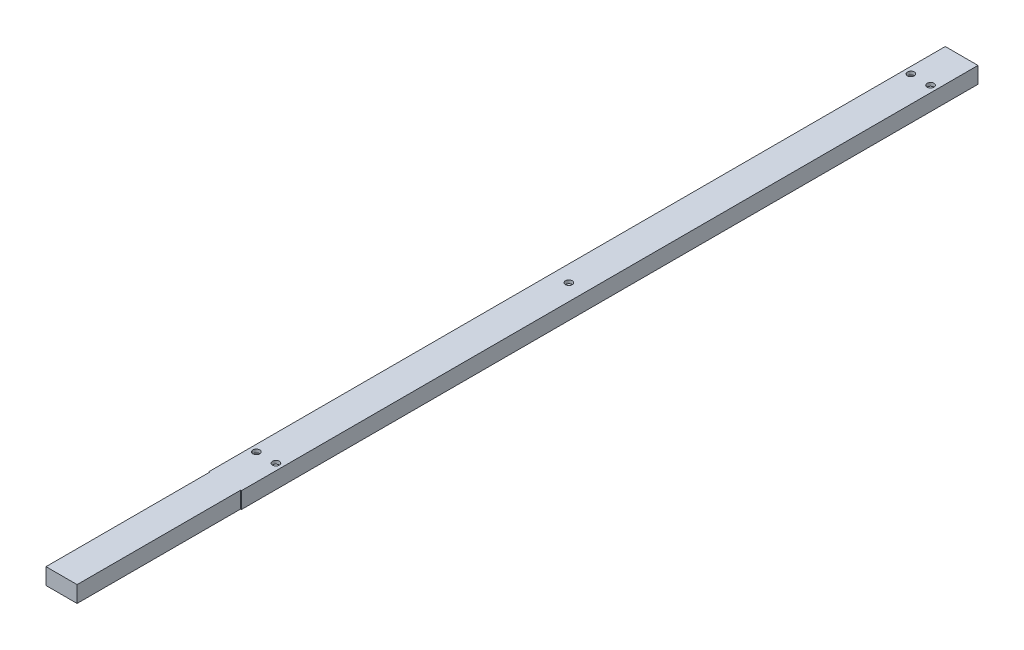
ISO-10303-21;
HEADER;
FILE_DESCRIPTION(('STEP AP214'),'2;1');
FILE_NAME('part.step','',(''),(''),'','','');
FILE_SCHEMA(('AUTOMOTIVE_DESIGN { 1 0 10303 214 1 1 1 1 }'));
ENDSEC;
DATA;
#1=APPLICATION_CONTEXT('core data for automotive mechanical design processes');
#2=APPLICATION_PROTOCOL_DEFINITION('international standard','automotive_design',2000,#1);
#3=PRODUCT_CONTEXT('',#1,'mechanical');
#4=PRODUCT('Part','Part','',(#3));
#5=PRODUCT_RELATED_PRODUCT_CATEGORY('part','',(#4));
#6=PRODUCT_DEFINITION_FORMATION('','',#4);
#7=PRODUCT_DEFINITION_CONTEXT('part definition',#1,'design');
#8=PRODUCT_DEFINITION('design','',#6,#7);
#9=PRODUCT_DEFINITION_SHAPE('','',#8);
#10=(LENGTH_UNIT() NAMED_UNIT(*) SI_UNIT(.MILLI.,.METRE.));
#11=(NAMED_UNIT(*) PLANE_ANGLE_UNIT() SI_UNIT($,.RADIAN.));
#12=(NAMED_UNIT(*) SI_UNIT($,.STERADIAN.) SOLID_ANGLE_UNIT());
#13=UNCERTAINTY_MEASURE_WITH_UNIT(LENGTH_MEASURE(1.E-05),#10,'distance_accuracy_value','');
#14=(GEOMETRIC_REPRESENTATION_CONTEXT(3) GLOBAL_UNCERTAINTY_ASSIGNED_CONTEXT((#13)) GLOBAL_UNIT_ASSIGNED_CONTEXT((#10,
#11,#12)) REPRESENTATION_CONTEXT('',''));
#15=CARTESIAN_POINT('',(0.,0.,0.));
#16=DIRECTION('',(0.,0.,1.));
#17=DIRECTION('',(1.,0.,0.));
#18=AXIS2_PLACEMENT_3D('',#15,#16,#17);
#19=CARTESIAN_POINT('',(0.,0.,450.));
#20=DIRECTION('',(0.,0.,1.));
#21=DIRECTION('',(1.,0.,0.));
#22=AXIS2_PLACEMENT_3D('',#19,#20,#21);
#23=PLANE('',#22);
#24=DIRECTION('',(1.,0.,0.));
#25=VECTOR('',#24,1.);
#26=CARTESIAN_POINT('',(-10.,-5.,450.));
#27=LINE('',#26,#25);
#28=CARTESIAN_POINT('',(-10.,-5.,450.));
#29=VERTEX_POINT('',#28);
#30=CARTESIAN_POINT('',(-9.5,-5.,450.));
#31=VERTEX_POINT('',#30);
#32=EDGE_CURVE('E322',#29,#31,#27,.T.);
#33=ORIENTED_EDGE('',*,*,#32,.T.);
#34=DIRECTION('',(0.,1.,0.));
#35=VECTOR('',#34,1.);
#36=CARTESIAN_POINT('',(-9.5,5.,450.));
#37=LINE('',#36,#35);
#38=CARTESIAN_POINT('',(-9.5,5.,450.));
#39=VERTEX_POINT('',#38);
#40=EDGE_CURVE('E199',#31,#39,#37,.T.);
#41=ORIENTED_EDGE('',*,*,#40,.T.);
#42=DIRECTION('',(-1.,0.,0.));
#43=VECTOR('',#42,1.);
#44=CARTESIAN_POINT('',(-10.,5.,450.));
#45=LINE('',#44,#43);
#46=CARTESIAN_POINT('',(-10.,5.,450.));
#47=VERTEX_POINT('',#46);
#48=EDGE_CURVE('E178',#39,#47,#45,.T.);
#49=ORIENTED_EDGE('',*,*,#48,.T.);
#50=DIRECTION('',(0.,-1.,0.));
#51=VECTOR('',#50,1.);
#52=CARTESIAN_POINT('',(-10.,5.,450.));
#53=LINE('',#52,#51);
#54=EDGE_CURVE('E319',#47,#29,#53,.T.);
#55=ORIENTED_EDGE('',*,*,#54,.T.);
#56=EDGE_LOOP('',(#33,#41,#49,#55));
#57=FACE_BOUND('',#56,.T.);
#58=ADVANCED_FACE('F35',(#57),#23,.T.);
#59=CARTESIAN_POINT('',(10.,5.,450.));
#60=VERTEX_POINT('',#59);
#61=CARTESIAN_POINT('',(9.5,5.,450.));
#62=VERTEX_POINT('',#61);
#63=EDGE_CURVE('E316',#60,#62,#45,.T.);
#64=ORIENTED_EDGE('',*,*,#63,.T.);
#65=DIRECTION('',(0.,-1.,0.));
#66=VECTOR('',#65,1.);
#67=CARTESIAN_POINT('',(9.5,5.,450.));
#68=LINE('',#67,#66);
#69=CARTESIAN_POINT('',(9.5,-5.,450.));
#70=VERTEX_POINT('',#69);
#71=EDGE_CURVE('E197',#62,#70,#68,.T.);
#72=ORIENTED_EDGE('',*,*,#71,.T.);
#73=CARTESIAN_POINT('',(10.,-5.,450.));
#74=VERTEX_POINT('',#73);
#75=EDGE_CURVE('E321',#70,#74,#27,.T.);
#76=ORIENTED_EDGE('',*,*,#75,.T.);
#77=DIRECTION('',(0.,1.,0.));
#78=VECTOR('',#77,1.);
#79=CARTESIAN_POINT('',(10.,5.,450.));
#80=LINE('',#79,#78);
#81=EDGE_CURVE('E312',#74,#60,#80,.T.);
#82=ORIENTED_EDGE('',*,*,#81,.T.);
#83=EDGE_LOOP('',(#64,#72,#76,#82));
#84=FACE_BOUND('',#83,.T.);
#85=ADVANCED_FACE('F419',(#84),#23,.T.);
#86=CARTESIAN_POINT('',(-8.,3.,450.));
#87=DIRECTION('',(1.,0.,0.));
#88=DIRECTION('',(0.,0.,-1.));
#89=AXIS2_PLACEMENT_3D('',#86,#87,#88);
#90=PLANE('',#89);
#91=DIRECTION('',(0.,1.,0.));
#92=VECTOR('',#91,1.);
#93=CARTESIAN_POINT('',(-8.,5.,424.359687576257));
#94=LINE('',#93,#92);
#95=CARTESIAN_POINT('',(-8.,-3.,424.359687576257));
#96=VERTEX_POINT('',#95);
#97=CARTESIAN_POINT('',(-8.,3.,424.359687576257));
#98=VERTEX_POINT('',#97);
#99=EDGE_CURVE('E224',#96,#98,#94,.T.);
#100=ORIENTED_EDGE('',*,*,#99,.F.);
#101=DIRECTION('',(0.,0.,-1.));
#102=VECTOR('',#101,1.);
#103=CARTESIAN_POINT('',(-8.,-3.,450.));
#104=LINE('',#103,#102);
#105=CARTESIAN_POINT('',(-8.,-3.,25.6403124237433));
#106=VERTEX_POINT('',#105);
#107=EDGE_CURVE('E301',#96,#106,#104,.T.);
#108=ORIENTED_EDGE('',*,*,#107,.T.);
#109=DIRECTION('',(0.,1.,0.));
#110=VECTOR('',#109,1.);
#111=CARTESIAN_POINT('',(-8.,5.,25.6403124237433));
#112=LINE('',#111,#110);
#113=CARTESIAN_POINT('',(-8.,3.,25.6403124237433));
#114=VERTEX_POINT('',#113);
#115=EDGE_CURVE('E246',#114,#106,#112,.F.);
#116=ORIENTED_EDGE('',*,*,#115,.F.);
#117=DIRECTION('',(0.,0.,-1.));
#118=VECTOR('',#117,1.);
#119=CARTESIAN_POINT('',(-8.,3.,450.));
#120=LINE('',#119,#118);
#121=EDGE_CURVE('E306',#98,#114,#120,.T.);
#122=ORIENTED_EDGE('',*,*,#121,.F.);
#123=EDGE_LOOP('',(#100,#108,#116,#122));
#124=FACE_BOUND('',#123,.T.);
#125=ADVANCED_FACE('F397',(#124),#90,.T.);
#126=CARTESIAN_POINT('',(8.,3.,450.));
#127=DIRECTION('',(-1.,0.,0.));
#128=DIRECTION('',(0.,0.,1.));
#129=AXIS2_PLACEMENT_3D('',#126,#127,#128);
#130=PLANE('',#129);
#131=DIRECTION('',(0.,1.,0.));
#132=VECTOR('',#131,1.);
#133=CARTESIAN_POINT('',(8.,5.,425.640312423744));
#134=LINE('',#133,#132);
#135=CARTESIAN_POINT('',(8.,-3.,425.640312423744));
#136=VERTEX_POINT('',#135);
#137=CARTESIAN_POINT('',(8.,3.,425.640312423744));
#138=VERTEX_POINT('',#137);
#139=EDGE_CURVE('E236',#136,#138,#134,.T.);
#140=ORIENTED_EDGE('',*,*,#139,.F.);
#141=DIRECTION('',(0.,0.,-1.));
#142=VECTOR('',#141,1.);
#143=CARTESIAN_POINT('',(8.,-3.,450.));
#144=LINE('',#143,#142);
#145=CARTESIAN_POINT('',(8.,-3.,450.));
#146=VERTEX_POINT('',#145);
#147=EDGE_CURVE('E292',#146,#136,#144,.T.);
#148=ORIENTED_EDGE('',*,*,#147,.F.);
#149=DIRECTION('',(0.,1.,0.));
#150=VECTOR('',#149,1.);
#151=CARTESIAN_POINT('',(8.,3.,450.));
#152=LINE('',#151,#150);
#153=CARTESIAN_POINT('',(8.,3.,450.));
#154=VERTEX_POINT('',#153);
#155=EDGE_CURVE('E268',#146,#154,#152,.T.);
#156=ORIENTED_EDGE('',*,*,#155,.T.);
#157=DIRECTION('',(0.,0.,-1.));
#158=VECTOR('',#157,1.);
#159=CARTESIAN_POINT('',(8.,3.,450.));
#160=LINE('',#159,#158);
#161=EDGE_CURVE('E307',#154,#138,#160,.T.);
#162=ORIENTED_EDGE('',*,*,#161,.T.);
#163=EDGE_LOOP('',(#140,#148,#156,#162));
#164=FACE_BOUND('',#163,.T.);
#165=ADVANCED_FACE('F360',(#164),#130,.T.);
#166=DIRECTION('',(0.,1.,0.));
#167=VECTOR('',#166,1.);
#168=CARTESIAN_POINT('',(-8.,5.,24.3596875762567));
#169=LINE('',#168,#167);
#170=CARTESIAN_POINT('',(-8.,-3.,24.3596875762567));
#171=VERTEX_POINT('',#170);
#172=CARTESIAN_POINT('',(-8.,3.,24.3596875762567));
#173=VERTEX_POINT('',#172);
#174=EDGE_CURVE('E249',#171,#173,#169,.T.);
#175=ORIENTED_EDGE('',*,*,#174,.F.);
#176=CARTESIAN_POINT('',(-8.,-3.,0.));
#177=VERTEX_POINT('',#176);
#178=EDGE_CURVE('E295',#171,#177,#104,.T.);
#179=ORIENTED_EDGE('',*,*,#178,.T.);
#180=DIRECTION('',(0.,-1.,0.));
#181=VECTOR('',#180,1.);
#182=CARTESIAN_POINT('',(-8.,3.,0.));
#183=LINE('',#182,#181);
#184=CARTESIAN_POINT('',(-8.,3.,0.));
#185=VERTEX_POINT('',#184);
#186=EDGE_CURVE('E287',#185,#177,#183,.T.);
#187=ORIENTED_EDGE('',*,*,#186,.F.);
#188=EDGE_CURVE('E300',#173,#185,#120,.T.);
#189=ORIENTED_EDGE('',*,*,#188,.F.);
#190=EDGE_LOOP('',(#175,#179,#187,#189));
#191=FACE_BOUND('',#190,.T.);
#192=ADVANCED_FACE('F391',(#191),#90,.T.);
#193=DIRECTION('',(0.,1.,0.));
#194=VECTOR('',#193,1.);
#195=CARTESIAN_POINT('',(8.,5.,424.359687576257));
#196=LINE('',#195,#194);
#197=CARTESIAN_POINT('',(8.,3.,424.359687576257));
#198=VERTEX_POINT('',#197);
#199=CARTESIAN_POINT('',(8.,-3.,424.359687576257));
#200=VERTEX_POINT('',#199);
#201=EDGE_CURVE('E234',#198,#200,#196,.F.);
#202=ORIENTED_EDGE('',*,*,#201,.F.);
#203=CARTESIAN_POINT('',(8.,3.,25.6403124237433));
#204=VERTEX_POINT('',#203);
#205=EDGE_CURVE('E311',#198,#204,#160,.T.);
#206=ORIENTED_EDGE('',*,*,#205,.T.);
#207=DIRECTION('',(0.,1.,0.));
#208=VECTOR('',#207,1.);
#209=CARTESIAN_POINT('',(8.,5.,25.6403124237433));
#210=LINE('',#209,#208);
#211=CARTESIAN_POINT('',(8.,-3.,25.6403124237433));
#212=VERTEX_POINT('',#211);
#213=EDGE_CURVE('E264',#212,#204,#210,.T.);
#214=ORIENTED_EDGE('',*,*,#213,.F.);
#215=EDGE_CURVE('E296',#200,#212,#144,.T.);
#216=ORIENTED_EDGE('',*,*,#215,.F.);
#217=EDGE_LOOP('',(#202,#206,#214,#216));
#218=FACE_BOUND('',#217,.T.);
#219=ADVANCED_FACE('F373',(#218),#130,.T.);
#220=CARTESIAN_POINT('',(0.,0.,0.));
#221=DIRECTION('',(0.,0.,1.));
#222=DIRECTION('',(1.,0.,0.));
#223=AXIS2_PLACEMENT_3D('',#220,#221,#222);
#224=PLANE('',#223);
#225=DIRECTION('',(0.,1.,0.));
#226=VECTOR('',#225,1.);
#227=CARTESIAN_POINT('',(10.,5.,0.));
#228=LINE('',#227,#226);
#229=CARTESIAN_POINT('',(10.,-5.,0.));
#230=VERTEX_POINT('',#229);
#231=CARTESIAN_POINT('',(10.,5.,0.));
#232=VERTEX_POINT('',#231);
#233=EDGE_CURVE('E310',#230,#232,#228,.T.);
#234=ORIENTED_EDGE('',*,*,#233,.F.);
#235=DIRECTION('',(1.,0.,0.));
#236=VECTOR('',#235,1.);
#237=CARTESIAN_POINT('',(-10.,-5.,0.));
#238=LINE('',#237,#236);
#239=CARTESIAN_POINT('',(-10.,-5.,0.));
#240=VERTEX_POINT('',#239);
#241=EDGE_CURVE('E315',#240,#230,#238,.T.);
#242=ORIENTED_EDGE('',*,*,#241,.F.);
#243=DIRECTION('',(0.,-1.,0.));
#244=VECTOR('',#243,1.);
#245=CARTESIAN_POINT('',(-10.,5.,0.));
#246=LINE('',#245,#244);
#247=CARTESIAN_POINT('',(-10.,5.,0.));
#248=VERTEX_POINT('',#247);
#249=EDGE_CURVE('E330',#248,#240,#246,.T.);
#250=ORIENTED_EDGE('',*,*,#249,.F.);
#251=DIRECTION('',(-1.,0.,0.));
#252=VECTOR('',#251,1.);
#253=CARTESIAN_POINT('',(-10.,5.,0.));
#254=LINE('',#253,#252);
#255=EDGE_CURVE('E328',#232,#248,#254,.T.);
#256=ORIENTED_EDGE('',*,*,#255,.F.);
#257=EDGE_LOOP('',(#234,#242,#250,#256));
#258=FACE_BOUND('',#257,.T.);
#259=DIRECTION('',(0.,1.,0.));
#260=VECTOR('',#259,1.);
#261=CARTESIAN_POINT('',(8.,3.,0.));
#262=LINE('',#261,#260);
#263=CARTESIAN_POINT('',(8.,-3.,0.));
#264=VERTEX_POINT('',#263);
#265=CARTESIAN_POINT('',(8.,3.,0.));
#266=VERTEX_POINT('',#265);
#267=EDGE_CURVE('E267',#264,#266,#262,.T.);
#268=ORIENTED_EDGE('',*,*,#267,.T.);
#269=DIRECTION('',(-1.,0.,0.));
#270=VECTOR('',#269,1.);
#271=CARTESIAN_POINT('',(-8.,3.,0.));
#272=LINE('',#271,#270);
#273=EDGE_CURVE('E284',#266,#185,#272,.T.);
#274=ORIENTED_EDGE('',*,*,#273,.T.);
#275=ORIENTED_EDGE('',*,*,#186,.T.);
#276=DIRECTION('',(1.,0.,0.));
#277=VECTOR('',#276,1.);
#278=CARTESIAN_POINT('',(-8.,-3.,0.));
#279=LINE('',#278,#277);
#280=EDGE_CURVE('E272',#177,#264,#279,.T.);
#281=ORIENTED_EDGE('',*,*,#280,.T.);
#282=EDGE_LOOP('',(#268,#274,#275,#281));
#283=FACE_BOUND('',#282,.T.);
#284=ADVANCED_FACE('F386',(#258,#283),#224,.F.);
#285=CARTESIAN_POINT('',(10.,5.,450.));
#286=DIRECTION('',(-1.,0.,0.));
#287=DIRECTION('',(0.,-1.,0.));
#288=AXIS2_PLACEMENT_3D('',#285,#286,#287);
#289=PLANE('',#288);
#290=ORIENTED_EDGE('',*,*,#233,.T.);
#291=DIRECTION('',(0.,0.,-1.));
#292=VECTOR('',#291,1.);
#293=CARTESIAN_POINT('',(10.,5.,450.));
#294=LINE('',#293,#292);
#295=EDGE_CURVE('E341',#60,#232,#294,.T.);
#296=ORIENTED_EDGE('',*,*,#295,.F.);
#297=ORIENTED_EDGE('',*,*,#81,.F.);
#298=DIRECTION('',(0.,0.,-1.));
#299=VECTOR('',#298,1.);
#300=CARTESIAN_POINT('',(10.,-5.,450.));
#301=LINE('',#300,#299);
#302=EDGE_CURVE('E325',#74,#230,#301,.T.);
#303=ORIENTED_EDGE('',*,*,#302,.T.);
#304=EDGE_LOOP('',(#290,#296,#297,#303));
#305=FACE_BOUND('',#304,.T.);
#306=ADVANCED_FACE('F37',(#305),#289,.F.);
#307=CARTESIAN_POINT('',(-10.,5.,450.));
#308=DIRECTION('',(0.,-1.,0.));
#309=DIRECTION('',(0.,0.,-1.));
#310=AXIS2_PLACEMENT_3D('',#307,#308,#309);
#311=PLANE('',#310);
#312=CARTESIAN_POINT('',(0.,5.,240.));
#313=DIRECTION('',(0.,-1.,0.));
#314=DIRECTION('',(0.,0.,-1.));
#315=AXIS2_PLACEMENT_3D('',#312,#313,#314);
#316=CIRCLE('',#315,2.1);
#317=CARTESIAN_POINT('',(0.,5.,237.9));
#318=VERTEX_POINT('',#317);
#319=EDGE_CURVE('E211',#318,#318,#316,.T.);
#320=ORIENTED_EDGE('',*,*,#319,.T.);
#321=EDGE_LOOP('',(#320));
#322=FACE_BOUND('',#321,.T.);
#323=CARTESIAN_POINT('',(-5.99999999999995,5.,425.));
#324=DIRECTION('',(0.,1.,0.));
#325=DIRECTION('',(0.,0.,1.));
#326=AXIS2_PLACEMENT_3D('',#323,#324,#325);
#327=CIRCLE('',#326,2.1);
#328=CARTESIAN_POINT('',(-5.99999999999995,5.,427.1));
#329=VERTEX_POINT('',#328);
#330=EDGE_CURVE('E217',#329,#329,#327,.T.);
#331=ORIENTED_EDGE('',*,*,#330,.F.);
#332=EDGE_LOOP('',(#331));
#333=FACE_BOUND('',#332,.T.);
#334=CARTESIAN_POINT('',(6.00000000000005,5.,425.));
#335=DIRECTION('',(0.,1.,0.));
#336=DIRECTION('',(0.,0.,1.));
#337=AXIS2_PLACEMENT_3D('',#334,#335,#336);
#338=CIRCLE('',#337,2.1);
#339=CARTESIAN_POINT('',(6.00000000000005,5.,427.1));
#340=VERTEX_POINT('',#339);
#341=EDGE_CURVE('E228',#340,#340,#338,.T.);
#342=ORIENTED_EDGE('',*,*,#341,.F.);
#343=EDGE_LOOP('',(#342));
#344=FACE_BOUND('',#343,.T.);
#345=CARTESIAN_POINT('',(-6.,5.,25.));
#346=DIRECTION('',(0.,1.,0.));
#347=DIRECTION('',(0.,0.,1.));
#348=AXIS2_PLACEMENT_3D('',#345,#346,#347);
#349=CIRCLE('',#348,2.1);
#350=CARTESIAN_POINT('',(-6.,5.,27.1));
#351=VERTEX_POINT('',#350);
#352=EDGE_CURVE('E240',#351,#351,#349,.T.);
#353=ORIENTED_EDGE('',*,*,#352,.F.);
#354=EDGE_LOOP('',(#353));
#355=FACE_BOUND('',#354,.T.);
#356=CARTESIAN_POINT('',(6.,5.,25.));
#357=DIRECTION('',(0.,1.,0.));
#358=DIRECTION('',(0.,0.,1.));
#359=AXIS2_PLACEMENT_3D('',#356,#357,#358);
#360=CIRCLE('',#359,2.1);
#361=CARTESIAN_POINT('',(6.,5.,27.1));
#362=VERTEX_POINT('',#361);
#363=EDGE_CURVE('E254',#362,#362,#360,.T.);
#364=ORIENTED_EDGE('',*,*,#363,.F.);
#365=EDGE_LOOP('',(#364));
#366=FACE_BOUND('',#365,.T.);
#367=ORIENTED_EDGE('',*,*,#255,.T.);
#368=DIRECTION('',(0.,0.,-1.));
#369=VECTOR('',#368,1.);
#370=CARTESIAN_POINT('',(-10.,5.,450.));
#371=LINE('',#370,#369);
#372=EDGE_CURVE('E338',#47,#248,#371,.T.);
#373=ORIENTED_EDGE('',*,*,#372,.F.);
#374=ORIENTED_EDGE('',*,*,#48,.F.);
#375=DIRECTION('',(0.,0.,-1.));
#376=VECTOR('',#375,1.);
#377=CARTESIAN_POINT('',(-9.5,5.,550.));
#378=LINE('',#377,#376);
#379=CARTESIAN_POINT('',(-9.5,5.,550.));
#380=VERTEX_POINT('',#379);
#381=EDGE_CURVE('E173',#380,#39,#378,.T.);
#382=ORIENTED_EDGE('',*,*,#381,.F.);
#383=DIRECTION('',(1.,0.,0.));
#384=VECTOR('',#383,1.);
#385=CARTESIAN_POINT('',(9.5,5.,550.));
#386=LINE('',#385,#384);
#387=CARTESIAN_POINT('',(9.5,5.,550.));
#388=VERTEX_POINT('',#387);
#389=EDGE_CURVE('E176',#380,#388,#386,.T.);
#390=ORIENTED_EDGE('',*,*,#389,.T.);
#391=DIRECTION('',(0.,0.,-1.));
#392=VECTOR('',#391,1.);
#393=CARTESIAN_POINT('',(9.5,5.,550.));
#394=LINE('',#393,#392);
#395=EDGE_CURVE('E183',#388,#62,#394,.T.);
#396=ORIENTED_EDGE('',*,*,#395,.T.);
#397=ORIENTED_EDGE('',*,*,#63,.F.);
#398=ORIENTED_EDGE('',*,*,#295,.T.);
#399=EDGE_LOOP('',(#367,#373,#374,#382,#390,#396,#397,#398));
#400=FACE_BOUND('',#399,.T.);
#401=ADVANCED_FACE('F175',(#322,#333,#344,#355,#366,#400),#311,.F.);
#402=CARTESIAN_POINT('',(-10.,5.,450.));
#403=DIRECTION('',(1.,0.,0.));
#404=DIRECTION('',(0.,0.,-1.));
#405=AXIS2_PLACEMENT_3D('',#402,#403,#404);
#406=PLANE('',#405);
#407=ORIENTED_EDGE('',*,*,#249,.T.);
#408=DIRECTION('',(0.,0.,-1.));
#409=VECTOR('',#408,1.);
#410=CARTESIAN_POINT('',(-10.,-5.,450.));
#411=LINE('',#410,#409);
#412=EDGE_CURVE('E335',#29,#240,#411,.T.);
#413=ORIENTED_EDGE('',*,*,#412,.F.);
#414=ORIENTED_EDGE('',*,*,#54,.F.);
#415=ORIENTED_EDGE('',*,*,#372,.T.);
#416=EDGE_LOOP('',(#407,#413,#414,#415));
#417=FACE_BOUND('',#416,.T.);
#418=ADVANCED_FACE('F437',(#417),#406,.F.);
#419=CARTESIAN_POINT('',(-10.,-5.,450.));
#420=DIRECTION('',(0.,1.,0.));
#421=DIRECTION('',(0.,0.,1.));
#422=AXIS2_PLACEMENT_3D('',#419,#420,#421);
#423=PLANE('',#422);
#424=CARTESIAN_POINT('',(0.,-5.,240.));
#425=DIRECTION('',(0.,-1.,0.));
#426=DIRECTION('',(0.,0.,-1.));
#427=AXIS2_PLACEMENT_3D('',#424,#425,#426);
#428=CIRCLE('',#427,2.09999999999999);
#429=CARTESIAN_POINT('',(0.,-5.,237.9));
#430=VERTEX_POINT('',#429);
#431=EDGE_CURVE('E206',#430,#430,#428,.T.);
#432=ORIENTED_EDGE('',*,*,#431,.F.);
#433=EDGE_LOOP('',(#432));
#434=FACE_BOUND('',#433,.T.);
#435=CARTESIAN_POINT('',(-5.99999999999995,-5.,425.));
#436=DIRECTION('',(0.,1.,0.));
#437=DIRECTION('',(0.,0.,1.));
#438=AXIS2_PLACEMENT_3D('',#435,#436,#437);
#439=CIRCLE('',#438,2.1);
#440=CARTESIAN_POINT('',(-5.99999999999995,-5.,427.1));
#441=VERTEX_POINT('',#440);
#442=EDGE_CURVE('E220',#441,#441,#439,.T.);
#443=ORIENTED_EDGE('',*,*,#442,.T.);
#444=EDGE_LOOP('',(#443));
#445=FACE_BOUND('',#444,.T.);
#446=CARTESIAN_POINT('',(6.00000000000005,-5.,425.));
#447=DIRECTION('',(0.,1.,0.));
#448=DIRECTION('',(0.,0.,1.));
#449=AXIS2_PLACEMENT_3D('',#446,#447,#448);
#450=CIRCLE('',#449,2.1);
#451=CARTESIAN_POINT('',(6.00000000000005,-5.,427.1));
#452=VERTEX_POINT('',#451);
#453=EDGE_CURVE('E231',#452,#452,#450,.T.);
#454=ORIENTED_EDGE('',*,*,#453,.T.);
#455=EDGE_LOOP('',(#454));
#456=FACE_BOUND('',#455,.T.);
#457=CARTESIAN_POINT('',(-6.,-5.,25.));
#458=DIRECTION('',(0.,1.,0.));
#459=DIRECTION('',(0.,0.,1.));
#460=AXIS2_PLACEMENT_3D('',#457,#458,#459);
#461=CIRCLE('',#460,2.1);
#462=CARTESIAN_POINT('',(-6.,-5.,27.1));
#463=VERTEX_POINT('',#462);
#464=EDGE_CURVE('E243',#463,#463,#461,.T.);
#465=ORIENTED_EDGE('',*,*,#464,.T.);
#466=EDGE_LOOP('',(#465));
#467=FACE_BOUND('',#466,.T.);
#468=CARTESIAN_POINT('',(6.,-5.,25.));
#469=DIRECTION('',(0.,1.,0.));
#470=DIRECTION('',(0.,0.,1.));
#471=AXIS2_PLACEMENT_3D('',#468,#469,#470);
#472=CIRCLE('',#471,2.1);
#473=CARTESIAN_POINT('',(6.,-5.,27.1));
#474=VERTEX_POINT('',#473);
#475=EDGE_CURVE('E257',#474,#474,#472,.T.);
#476=ORIENTED_EDGE('',*,*,#475,.T.);
#477=EDGE_LOOP('',(#476));
#478=FACE_BOUND('',#477,.T.);
#479=ORIENTED_EDGE('',*,*,#241,.T.);
#480=ORIENTED_EDGE('',*,*,#302,.F.);
#481=ORIENTED_EDGE('',*,*,#75,.F.);
#482=DIRECTION('',(0.,0.,-1.));
#483=VECTOR('',#482,1.);
#484=CARTESIAN_POINT('',(9.5,-5.,550.));
#485=LINE('',#484,#483);
#486=CARTESIAN_POINT('',(9.5,-5.,550.));
#487=VERTEX_POINT('',#486);
#488=EDGE_CURVE('E51',#487,#70,#485,.T.);
#489=ORIENTED_EDGE('',*,*,#488,.F.);
#490=DIRECTION('',(-1.,0.,0.));
#491=VECTOR('',#490,1.);
#492=CARTESIAN_POINT('',(9.5,-5.,550.));
#493=LINE('',#492,#491);
#494=CARTESIAN_POINT('',(-9.5,-5.,550.));
#495=VERTEX_POINT('',#494);
#496=EDGE_CURVE('E184',#487,#495,#493,.T.);
#497=ORIENTED_EDGE('',*,*,#496,.T.);
#498=DIRECTION('',(0.,0.,-1.));
#499=VECTOR('',#498,1.);
#500=CARTESIAN_POINT('',(-9.5,-5.,550.));
#501=LINE('',#500,#499);
#502=EDGE_CURVE('E196',#495,#31,#501,.T.);
#503=ORIENTED_EDGE('',*,*,#502,.T.);
#504=ORIENTED_EDGE('',*,*,#32,.F.);
#505=ORIENTED_EDGE('',*,*,#412,.T.);
#506=EDGE_LOOP('',(#479,#480,#481,#489,#497,#503,#504,#505));
#507=FACE_BOUND('',#506,.T.);
#508=ADVANCED_FACE('F434',(#434,#445,#456,#467,#478,#507),#423,.F.);
#509=DIRECTION('',(0.,1.,0.));
#510=VECTOR('',#509,1.);
#511=CARTESIAN_POINT('',(8.,5.,24.3596875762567));
#512=LINE('',#511,#510);
#513=CARTESIAN_POINT('',(8.,3.,24.3596875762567));
#514=VERTEX_POINT('',#513);
#515=CARTESIAN_POINT('',(8.,-3.,24.3596875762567));
#516=VERTEX_POINT('',#515);
#517=EDGE_CURVE('E260',#514,#516,#512,.F.);
#518=ORIENTED_EDGE('',*,*,#517,.F.);
#519=EDGE_CURVE('E305',#514,#266,#160,.T.);
#520=ORIENTED_EDGE('',*,*,#519,.T.);
#521=ORIENTED_EDGE('',*,*,#267,.F.);
#522=EDGE_CURVE('E281',#516,#264,#144,.T.);
#523=ORIENTED_EDGE('',*,*,#522,.F.);
#524=EDGE_LOOP('',(#518,#520,#521,#523));
#525=FACE_BOUND('',#524,.T.);
#526=ADVANCED_FACE('F382',(#525),#130,.T.);
#527=CARTESIAN_POINT('',(-8.,3.,450.));
#528=DIRECTION('',(0.,-1.,0.));
#529=DIRECTION('',(0.,0.,-1.));
#530=AXIS2_PLACEMENT_3D('',#527,#528,#529);
#531=PLANE('',#530);
#532=CARTESIAN_POINT('',(0.,3.,240.));
#533=DIRECTION('',(0.,-1.,0.));
#534=DIRECTION('',(0.,0.,-1.));
#535=AXIS2_PLACEMENT_3D('',#532,#533,#534);
#536=CIRCLE('',#535,2.09999999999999);
#537=CARTESIAN_POINT('',(0.,3.,237.9));
#538=VERTEX_POINT('',#537);
#539=EDGE_CURVE('E214',#538,#538,#536,.T.);
#540=ORIENTED_EDGE('',*,*,#539,.F.);
#541=EDGE_LOOP('',(#540));
#542=FACE_BOUND('',#541,.T.);
#543=CARTESIAN_POINT('',(-5.99999999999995,3.,425.));
#544=DIRECTION('',(0.,-1.,0.));
#545=DIRECTION('',(0.,0.,-1.));
#546=AXIS2_PLACEMENT_3D('',#543,#544,#545);
#547=CIRCLE('',#546,2.1);
#548=CARTESIAN_POINT('',(-8.,3.,425.640312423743));
#549=VERTEX_POINT('',#548);
#550=EDGE_CURVE('E226',#98,#549,#547,.T.);
#551=ORIENTED_EDGE('',*,*,#550,.F.);
#552=ORIENTED_EDGE('',*,*,#121,.T.);
#553=CARTESIAN_POINT('',(-6.,3.,25.));
#554=DIRECTION('',(0.,-1.,0.));
#555=DIRECTION('',(0.,0.,-1.));
#556=AXIS2_PLACEMENT_3D('',#553,#554,#555);
#557=CIRCLE('',#556,2.1);
#558=EDGE_CURVE('E251',#173,#114,#557,.T.);
#559=ORIENTED_EDGE('',*,*,#558,.F.);
#560=ORIENTED_EDGE('',*,*,#188,.T.);
#561=ORIENTED_EDGE('',*,*,#273,.F.);
#562=ORIENTED_EDGE('',*,*,#519,.F.);
#563=CARTESIAN_POINT('',(6.,3.,25.));
#564=DIRECTION('',(0.,-1.,0.));
#565=DIRECTION('',(0.,0.,-1.));
#566=AXIS2_PLACEMENT_3D('',#563,#564,#565);
#567=CIRCLE('',#566,2.1);
#568=EDGE_CURVE('E262',#204,#514,#567,.T.);
#569=ORIENTED_EDGE('',*,*,#568,.F.);
#570=ORIENTED_EDGE('',*,*,#205,.F.);
#571=CARTESIAN_POINT('',(6.00000000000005,3.,425.));
#572=DIRECTION('',(0.,-1.,0.));
#573=DIRECTION('',(0.,0.,-1.));
#574=AXIS2_PLACEMENT_3D('',#571,#572,#573);
#575=CIRCLE('',#574,2.1);
#576=EDGE_CURVE('E238',#138,#198,#575,.T.);
#577=ORIENTED_EDGE('',*,*,#576,.F.);
#578=ORIENTED_EDGE('',*,*,#161,.F.);
#579=DIRECTION('',(-1.,0.,0.));
#580=VECTOR('',#579,1.);
#581=CARTESIAN_POINT('',(-8.,3.,450.));
#582=LINE('',#581,#580);
#583=CARTESIAN_POINT('',(-8.,3.,450.));
#584=VERTEX_POINT('',#583);
#585=EDGE_CURVE('E271',#154,#584,#582,.T.);
#586=ORIENTED_EDGE('',*,*,#585,.T.);
#587=EDGE_CURVE('E302',#584,#549,#120,.T.);
#588=ORIENTED_EDGE('',*,*,#587,.T.);
#589=EDGE_LOOP('',(#551,#552,#559,#560,#561,#562,#569,#570,#577,#578,#586,#588));
#590=FACE_BOUND('',#589,.T.);
#591=ADVANCED_FACE('F368',(#542,#590),#531,.T.);
#592=DIRECTION('',(0.,1.,0.));
#593=VECTOR('',#592,1.);
#594=CARTESIAN_POINT('',(-8.,5.,425.640312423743));
#595=LINE('',#594,#593);
#596=CARTESIAN_POINT('',(-8.,-3.,425.640312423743));
#597=VERTEX_POINT('',#596);
#598=EDGE_CURVE('E58',#549,#597,#595,.F.);
#599=ORIENTED_EDGE('',*,*,#598,.F.);
#600=ORIENTED_EDGE('',*,*,#587,.F.);
#601=DIRECTION('',(0.,-1.,0.));
#602=VECTOR('',#601,1.);
#603=CARTESIAN_POINT('',(-8.,3.,450.));
#604=LINE('',#603,#602);
#605=CARTESIAN_POINT('',(-8.,-3.,450.));
#606=VERTEX_POINT('',#605);
#607=EDGE_CURVE('E275',#584,#606,#604,.T.);
#608=ORIENTED_EDGE('',*,*,#607,.T.);
#609=EDGE_CURVE('E297',#606,#597,#104,.T.);
#610=ORIENTED_EDGE('',*,*,#609,.T.);
#611=EDGE_LOOP('',(#599,#600,#608,#610));
#612=FACE_BOUND('',#611,.T.);
#613=ADVANCED_FACE('F406',(#612),#90,.T.);
#614=CARTESIAN_POINT('',(-8.,-3.,450.));
#615=DIRECTION('',(0.,1.,0.));
#616=DIRECTION('',(0.,0.,1.));
#617=AXIS2_PLACEMENT_3D('',#614,#615,#616);
#618=PLANE('',#617);
#619=CARTESIAN_POINT('',(0.,-3.,240.));
#620=DIRECTION('',(0.,1.,0.));
#621=DIRECTION('',(0.,0.,1.));
#622=AXIS2_PLACEMENT_3D('',#619,#620,#621);
#623=CIRCLE('',#622,2.09999999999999);
#624=CARTESIAN_POINT('',(0.,-3.,242.1));
#625=VERTEX_POINT('',#624);
#626=EDGE_CURVE('E39',#625,#625,#623,.T.);
#627=ORIENTED_EDGE('',*,*,#626,.F.);
#628=EDGE_LOOP('',(#627));
#629=FACE_BOUND('',#628,.T.);
#630=CARTESIAN_POINT('',(-5.99999999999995,-3.,425.));
#631=DIRECTION('',(0.,1.,0.));
#632=DIRECTION('',(0.,0.,1.));
#633=AXIS2_PLACEMENT_3D('',#630,#631,#632);
#634=CIRCLE('',#633,2.1);
#635=EDGE_CURVE('E11',#597,#96,#634,.T.);
#636=ORIENTED_EDGE('',*,*,#635,.F.);
#637=ORIENTED_EDGE('',*,*,#609,.F.);
#638=DIRECTION('',(1.,0.,0.));
#639=VECTOR('',#638,1.);
#640=CARTESIAN_POINT('',(-8.,-3.,450.));
#641=LINE('',#640,#639);
#642=EDGE_CURVE('E278',#606,#146,#641,.T.);
#643=ORIENTED_EDGE('',*,*,#642,.T.);
#644=ORIENTED_EDGE('',*,*,#147,.T.);
#645=CARTESIAN_POINT('',(6.00000000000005,-3.,425.));
#646=DIRECTION('',(0.,1.,0.));
#647=DIRECTION('',(0.,0.,1.));
#648=AXIS2_PLACEMENT_3D('',#645,#646,#647);
#649=CIRCLE('',#648,2.1);
#650=EDGE_CURVE('E44',#200,#136,#649,.T.);
#651=ORIENTED_EDGE('',*,*,#650,.F.);
#652=ORIENTED_EDGE('',*,*,#215,.T.);
#653=CARTESIAN_POINT('',(6.,-3.,25.));
#654=DIRECTION('',(0.,1.,0.));
#655=DIRECTION('',(0.,0.,1.));
#656=AXIS2_PLACEMENT_3D('',#653,#654,#655);
#657=CIRCLE('',#656,2.1);
#658=EDGE_CURVE('E344',#516,#212,#657,.T.);
#659=ORIENTED_EDGE('',*,*,#658,.F.);
#660=ORIENTED_EDGE('',*,*,#522,.T.);
#661=ORIENTED_EDGE('',*,*,#280,.F.);
#662=ORIENTED_EDGE('',*,*,#178,.F.);
#663=CARTESIAN_POINT('',(-6.,-3.,25.));
#664=DIRECTION('',(0.,1.,0.));
#665=DIRECTION('',(0.,0.,1.));
#666=AXIS2_PLACEMENT_3D('',#663,#664,#665);
#667=CIRCLE('',#666,2.1);
#668=EDGE_CURVE('E347',#106,#171,#667,.T.);
#669=ORIENTED_EDGE('',*,*,#668,.F.);
#670=ORIENTED_EDGE('',*,*,#107,.F.);
#671=EDGE_LOOP('',(#636,#637,#643,#644,#651,#652,#659,#660,#661,#662,#669,#670));
#672=FACE_BOUND('',#671,.T.);
#673=ADVANCED_FACE('F362',(#629,#672),#618,.T.);
#674=CARTESIAN_POINT('',(6.,5.,25.));
#675=DIRECTION('',(0.,1.,0.));
#676=DIRECTION('',(0.,0.,1.));
#677=AXIS2_PLACEMENT_3D('',#674,#675,#676);
#678=CYLINDRICAL_SURFACE('',#677,2.1);
#679=ORIENTED_EDGE('',*,*,#213,.T.);
#680=ORIENTED_EDGE('',*,*,#568,.T.);
#681=ORIENTED_EDGE('',*,*,#517,.T.);
#682=ORIENTED_EDGE('',*,*,#658,.T.);
#683=EDGE_LOOP('',(#679,#680,#681,#682));
#684=FACE_BOUND('',#683,.T.);
#685=ORIENTED_EDGE('',*,*,#475,.F.);
#686=EDGE_LOOP('',(#685));
#687=FACE_BOUND('',#686,.T.);
#688=ORIENTED_EDGE('',*,*,#363,.T.);
#689=EDGE_LOOP('',(#688));
#690=FACE_BOUND('',#689,.T.);
#691=ADVANCED_FACE('F413',(#684,#687,#690),#678,.F.);
#692=CARTESIAN_POINT('',(-6.,5.,25.));
#693=DIRECTION('',(0.,1.,0.));
#694=DIRECTION('',(0.,0.,1.));
#695=AXIS2_PLACEMENT_3D('',#692,#693,#694);
#696=CYLINDRICAL_SURFACE('',#695,2.1);
#697=ORIENTED_EDGE('',*,*,#558,.T.);
#698=ORIENTED_EDGE('',*,*,#115,.T.);
#699=ORIENTED_EDGE('',*,*,#668,.T.);
#700=ORIENTED_EDGE('',*,*,#174,.T.);
#701=EDGE_LOOP('',(#697,#698,#699,#700));
#702=FACE_BOUND('',#701,.T.);
#703=ORIENTED_EDGE('',*,*,#464,.F.);
#704=EDGE_LOOP('',(#703));
#705=FACE_BOUND('',#704,.T.);
#706=ORIENTED_EDGE('',*,*,#352,.T.);
#707=EDGE_LOOP('',(#706));
#708=FACE_BOUND('',#707,.T.);
#709=ADVANCED_FACE('F400',(#702,#705,#708),#696,.F.);
#710=CARTESIAN_POINT('',(6.00000000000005,5.,425.));
#711=DIRECTION('',(0.,1.,0.));
#712=DIRECTION('',(0.,0.,1.));
#713=AXIS2_PLACEMENT_3D('',#710,#711,#712);
#714=CYLINDRICAL_SURFACE('',#713,2.1);
#715=ORIENTED_EDGE('',*,*,#576,.T.);
#716=ORIENTED_EDGE('',*,*,#201,.T.);
#717=ORIENTED_EDGE('',*,*,#650,.T.);
#718=ORIENTED_EDGE('',*,*,#139,.T.);
#719=EDGE_LOOP('',(#715,#716,#717,#718));
#720=FACE_BOUND('',#719,.T.);
#721=ORIENTED_EDGE('',*,*,#453,.F.);
#722=EDGE_LOOP('',(#721));
#723=FACE_BOUND('',#722,.T.);
#724=ORIENTED_EDGE('',*,*,#341,.T.);
#725=EDGE_LOOP('',(#724));
#726=FACE_BOUND('',#725,.T.);
#727=ADVANCED_FACE('F352',(#720,#723,#726),#714,.F.);
#728=CARTESIAN_POINT('',(-5.99999999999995,5.,425.));
#729=DIRECTION('',(0.,1.,0.));
#730=DIRECTION('',(0.,0.,1.));
#731=AXIS2_PLACEMENT_3D('',#728,#729,#730);
#732=CYLINDRICAL_SURFACE('',#731,2.1);
#733=ORIENTED_EDGE('',*,*,#550,.T.);
#734=ORIENTED_EDGE('',*,*,#598,.T.);
#735=ORIENTED_EDGE('',*,*,#635,.T.);
#736=ORIENTED_EDGE('',*,*,#99,.T.);
#737=EDGE_LOOP('',(#733,#734,#735,#736));
#738=FACE_BOUND('',#737,.T.);
#739=ORIENTED_EDGE('',*,*,#442,.F.);
#740=EDGE_LOOP('',(#739));
#741=FACE_BOUND('',#740,.T.);
#742=ORIENTED_EDGE('',*,*,#330,.T.);
#743=EDGE_LOOP('',(#742));
#744=FACE_BOUND('',#743,.T.);
#745=ADVANCED_FACE('F403',(#738,#741,#744),#732,.F.);
#746=CARTESIAN_POINT('',(0.,-5.,240.));
#747=DIRECTION('',(0.,-1.,0.));
#748=DIRECTION('',(0.,0.,-1.));
#749=AXIS2_PLACEMENT_3D('',#746,#747,#748);
#750=CYLINDRICAL_SURFACE('',#749,2.09999999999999);
#751=ORIENTED_EDGE('',*,*,#626,.T.);
#752=EDGE_LOOP('',(#751));
#753=FACE_BOUND('',#752,.T.);
#754=ORIENTED_EDGE('',*,*,#431,.T.);
#755=EDGE_LOOP('',(#754));
#756=FACE_BOUND('',#755,.T.);
#757=ADVANCED_FACE('F472',(#753,#756),#750,.F.);
#758=ORIENTED_EDGE('',*,*,#539,.T.);
#759=EDGE_LOOP('',(#758));
#760=FACE_BOUND('',#759,.T.);
#761=ORIENTED_EDGE('',*,*,#319,.F.);
#762=EDGE_LOOP('',(#761));
#763=FACE_BOUND('',#762,.T.);
#764=ADVANCED_FACE('F475',(#760,#763),#750,.F.);
#765=CARTESIAN_POINT('',(0.,0.,550.));
#766=DIRECTION('',(0.,0.,-1.));
#767=DIRECTION('',(-1.,0.,0.));
#768=AXIS2_PLACEMENT_3D('',#765,#766,#767);
#769=PLANE('',#768);
#770=DIRECTION('',(0.,1.,0.));
#771=VECTOR('',#770,1.);
#772=CARTESIAN_POINT('',(-9.5,5.,550.));
#773=LINE('',#772,#771);
#774=EDGE_CURVE('E191',#495,#380,#773,.T.);
#775=ORIENTED_EDGE('',*,*,#774,.F.);
#776=ORIENTED_EDGE('',*,*,#496,.F.);
#777=DIRECTION('',(0.,-1.,0.));
#778=VECTOR('',#777,1.);
#779=CARTESIAN_POINT('',(9.5,5.,550.));
#780=LINE('',#779,#778);
#781=EDGE_CURVE('E193',#388,#487,#780,.T.);
#782=ORIENTED_EDGE('',*,*,#781,.F.);
#783=ORIENTED_EDGE('',*,*,#389,.F.);
#784=EDGE_LOOP('',(#775,#776,#782,#783));
#785=FACE_BOUND('',#784,.T.);
#786=ADVANCED_FACE('F189',(#785),#769,.F.);
#787=CARTESIAN_POINT('',(9.5,5.,550.));
#788=DIRECTION('',(1.,0.,0.));
#789=DIRECTION('',(0.,1.,0.));
#790=AXIS2_PLACEMENT_3D('',#787,#788,#789);
#791=PLANE('',#790);
#792=ORIENTED_EDGE('',*,*,#71,.F.);
#793=ORIENTED_EDGE('',*,*,#395,.F.);
#794=ORIENTED_EDGE('',*,*,#781,.T.);
#795=ORIENTED_EDGE('',*,*,#488,.T.);
#796=EDGE_LOOP('',(#792,#793,#794,#795));
#797=FACE_BOUND('',#796,.T.);
#798=ADVANCED_FACE('F479',(#797),#791,.T.);
#799=CARTESIAN_POINT('',(-9.5,5.,550.));
#800=DIRECTION('',(-1.,0.,0.));
#801=DIRECTION('',(0.,0.,1.));
#802=AXIS2_PLACEMENT_3D('',#799,#800,#801);
#803=PLANE('',#802);
#804=ORIENTED_EDGE('',*,*,#40,.F.);
#805=ORIENTED_EDGE('',*,*,#502,.F.);
#806=ORIENTED_EDGE('',*,*,#774,.T.);
#807=ORIENTED_EDGE('',*,*,#381,.T.);
#808=EDGE_LOOP('',(#804,#805,#806,#807));
#809=FACE_BOUND('',#808,.T.);
#810=ADVANCED_FACE('F195',(#809),#803,.T.);
#811=CARTESIAN_POINT('',(0.,0.,450.));
#812=DIRECTION('',(0.,0.,-1.));
#813=DIRECTION('',(-1.,0.,0.));
#814=AXIS2_PLACEMENT_3D('',#811,#812,#813);
#815=PLANE('',#814);
#816=ORIENTED_EDGE('',*,*,#585,.F.);
#817=ORIENTED_EDGE('',*,*,#155,.F.);
#818=ORIENTED_EDGE('',*,*,#642,.F.);
#819=ORIENTED_EDGE('',*,*,#607,.F.);
#820=EDGE_LOOP('',(#816,#817,#818,#819));
#821=FACE_BOUND('',#820,.T.);
#822=ADVANCED_FACE('F365',(#821),#815,.T.);
#823=CLOSED_SHELL('',(#58,#85,#125,#165,#192,#219,#284,#306,#401,#418,#508,#526,#591,#613,#673,
#691,#709,#727,#745,#757,#764,#786,#798,#810,#822));
#824=MANIFOLD_SOLID_BREP('B2',#823);
#825=ADVANCED_BREP_SHAPE_REPRESENTATION('',(#18,#824),#14);
#826=SHAPE_DEFINITION_REPRESENTATION(#9,#825);
ENDSEC;
END-ISO-10303-21;
